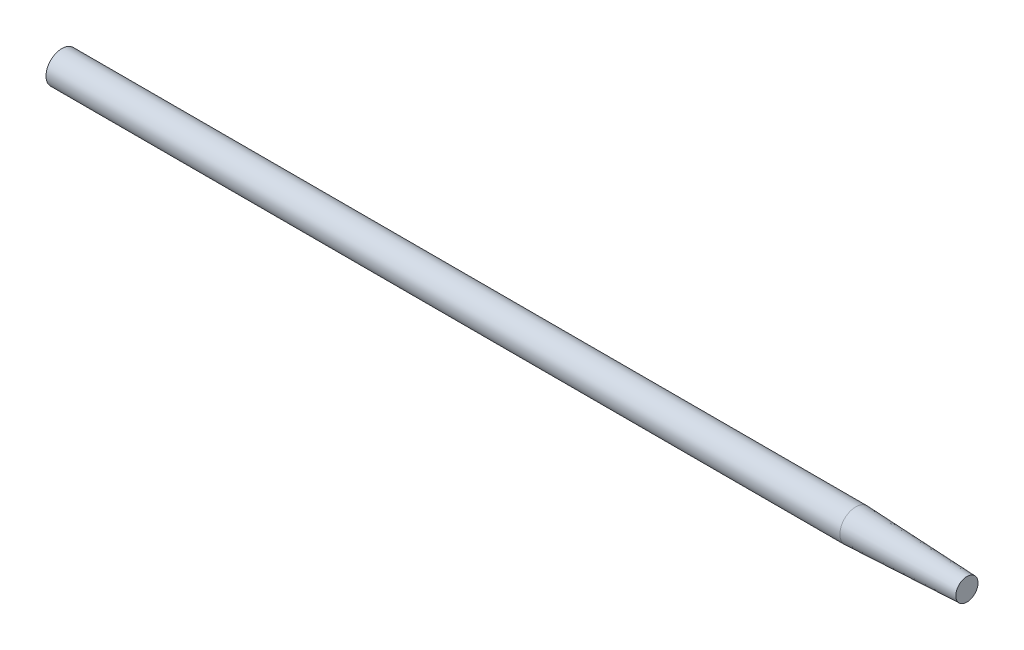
from build123d import *

# Parameters (mm, degrees)
IZIM1_W    = 570
IZIM1_H    = 10
PAH1_SIZE  = 3
PAH1_SIZE2 = 70


with BuildPart() as part:
    # izim1 → D_nd_r1 (revolve)
    with BuildSketch(Plane.XY, mode=Mode.PRIVATE) as d_nd_r1_sk:
        with Locations((285, 5)):
            Rectangle(IZIM1_W, IZIM1_H)
    revolve(d_nd_r1_sk.sketch.rotate(Axis((0, 0, 0), (1, 0, 0)), 90), axis=Axis((0, 0, 0), (1, 0, 0)))

    # Pah1
    pah1_edges = [part.edges().sort_by_distance(p)[0] for p in [
        (570, 0, -10),
    ]]
    pah1_side = [part.faces().sort_by_distance(p)[0] for p in [
        (570, 0, 0),
    ]]
    chamfer(pah1_edges, length=PAH1_SIZE, length2=PAH1_SIZE2, reference=pah1_side[0])


solid = part.part
